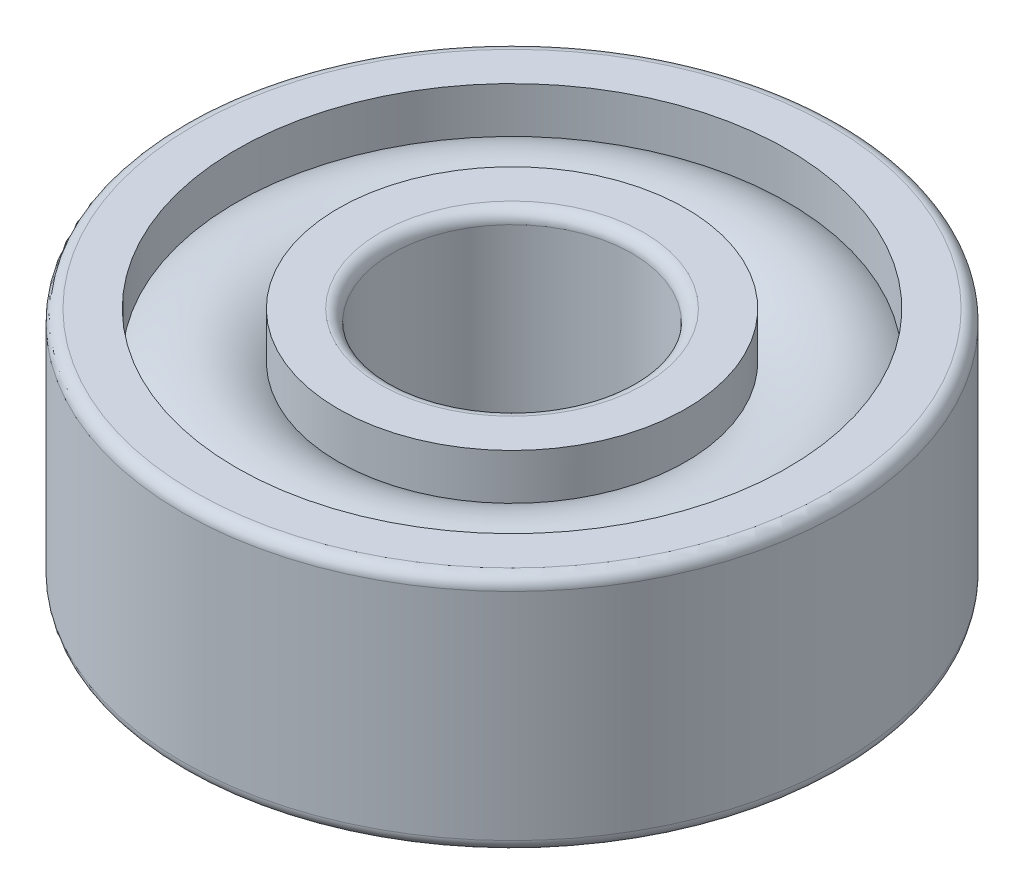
ISO-10303-21;
HEADER;
FILE_DESCRIPTION(('STEP AP214'),'2;1');
FILE_NAME('part.step','',(''),(''),'','','');
FILE_SCHEMA(('AUTOMOTIVE_DESIGN { 1 0 10303 214 1 1 1 1 }'));
ENDSEC;
DATA;
#1=APPLICATION_CONTEXT('core data for automotive mechanical design processes');
#2=APPLICATION_PROTOCOL_DEFINITION('international standard','automotive_design',2000,#1);
#3=PRODUCT_CONTEXT('',#1,'mechanical');
#4=PRODUCT('Part','Part','',(#3));
#5=PRODUCT_RELATED_PRODUCT_CATEGORY('part','',(#4));
#6=PRODUCT_DEFINITION_FORMATION('','',#4);
#7=PRODUCT_DEFINITION_CONTEXT('part definition',#1,'design');
#8=PRODUCT_DEFINITION('design','',#6,#7);
#9=PRODUCT_DEFINITION_SHAPE('','',#8);
#10=(LENGTH_UNIT() NAMED_UNIT(*) SI_UNIT(.MILLI.,.METRE.));
#11=(NAMED_UNIT(*) PLANE_ANGLE_UNIT() SI_UNIT($,.RADIAN.));
#12=(NAMED_UNIT(*) SI_UNIT($,.STERADIAN.) SOLID_ANGLE_UNIT());
#13=UNCERTAINTY_MEASURE_WITH_UNIT(LENGTH_MEASURE(1.E-05),#10,'distance_accuracy_value','');
#14=(GEOMETRIC_REPRESENTATION_CONTEXT(3) GLOBAL_UNCERTAINTY_ASSIGNED_CONTEXT((#13)) GLOBAL_UNIT_ASSIGNED_CONTEXT((#10,
#11,#12)) REPRESENTATION_CONTEXT('',''));
#15=CARTESIAN_POINT('',(0.,0.,0.));
#16=DIRECTION('',(0.,0.,1.));
#17=DIRECTION('',(1.,0.,0.));
#18=AXIS2_PLACEMENT_3D('',#15,#16,#17);
#19=CARTESIAN_POINT('',(0.,-2.2,0.));
#20=DIRECTION('',(0.,1.,0.));
#21=DIRECTION('',(0.,0.,1.));
#22=AXIS2_PLACEMENT_3D('',#19,#20,#21);
#23=CYLINDRICAL_SURFACE('',#22,2.);
#24=CARTESIAN_POINT('',(0.,1.8,0.));
#25=DIRECTION('',(0.,1.,0.));
#26=DIRECTION('',(0.,0.,-1.));
#27=AXIS2_PLACEMENT_3D('',#24,#25,#26);
#28=CIRCLE('',#27,2.);
#29=CARTESIAN_POINT('',(0.,1.8,-2.));
#30=VERTEX_POINT('',#29);
#31=EDGE_CURVE('E65',#30,#30,#28,.F.);
#32=ORIENTED_EDGE('',*,*,#31,.F.);
#33=EDGE_LOOP('',(#32));
#34=FACE_BOUND('',#33,.T.);
#35=CARTESIAN_POINT('',(0.,-1.8,0.));
#36=DIRECTION('',(0.,1.,0.));
#37=DIRECTION('',(0.,0.,-1.));
#38=AXIS2_PLACEMENT_3D('',#35,#36,#37);
#39=CIRCLE('',#38,2.);
#40=CARTESIAN_POINT('',(0.,-1.8,-2.));
#41=VERTEX_POINT('',#40);
#42=EDGE_CURVE('E127',#41,#41,#39,.T.);
#43=ORIENTED_EDGE('',*,*,#42,.F.);
#44=EDGE_LOOP('',(#43));
#45=FACE_BOUND('',#44,.T.);
#46=ADVANCED_FACE('F16',(#34,#45),#23,.F.);
#47=CARTESIAN_POINT('',(0.,-1.8,0.));
#48=DIRECTION('',(0.,1.,0.));
#49=DIRECTION('',(0.,0.,-1.));
#50=AXIS2_PLACEMENT_3D('',#47,#48,#49);
#51=TOROIDAL_SURFACE('',#50,2.2,0.2);
#52=ORIENTED_EDGE('',*,*,#42,.T.);
#53=EDGE_LOOP('',(#52));
#54=FACE_BOUND('',#53,.T.);
#55=CARTESIAN_POINT('',(0.,-2.,0.));
#56=DIRECTION('',(0.,-1.,0.));
#57=DIRECTION('',(0.,0.,1.));
#58=AXIS2_PLACEMENT_3D('',#55,#56,#57);
#59=CIRCLE('',#58,2.2);
#60=CARTESIAN_POINT('',(0.,-2.,2.2));
#61=VERTEX_POINT('',#60);
#62=CARTESIAN_POINT('',(0.,-2.,-2.2));
#63=VERTEX_POINT('',#62);
#64=EDGE_CURVE('E54',#61,#63,#59,.T.);
#65=ORIENTED_EDGE('',*,*,#64,.T.);
#66=CARTESIAN_POINT('',(0.,-2.,0.));
#67=DIRECTION('',(0.,-1.,0.));
#68=DIRECTION('',(0.,0.,-1.));
#69=AXIS2_PLACEMENT_3D('',#66,#67,#68);
#70=CIRCLE('',#69,2.2);
#71=EDGE_CURVE('E52',#63,#61,#70,.T.);
#72=ORIENTED_EDGE('',*,*,#71,.T.);
#73=EDGE_LOOP('',(#65,#72));
#74=FACE_BOUND('',#73,.T.);
#75=ADVANCED_FACE('F56',(#54,#74),#51,.T.);
#76=CARTESIAN_POINT('',(0.,1.8,0.));
#77=DIRECTION('',(0.,1.,0.));
#78=DIRECTION('',(0.,0.,-1.));
#79=AXIS2_PLACEMENT_3D('',#76,#77,#78);
#80=TOROIDAL_SURFACE('',#79,2.2,0.2);
#81=CARTESIAN_POINT('',(0.,2.,0.));
#82=DIRECTION('',(0.,1.,0.));
#83=DIRECTION('',(0.,0.,1.));
#84=AXIS2_PLACEMENT_3D('',#81,#82,#83);
#85=CIRCLE('',#84,2.2);
#86=CARTESIAN_POINT('',(0.,2.,-2.2));
#87=VERTEX_POINT('',#86);
#88=CARTESIAN_POINT('',(0.,2.,2.2));
#89=VERTEX_POINT('',#88);
#90=EDGE_CURVE('E59',#87,#89,#85,.F.);
#91=ORIENTED_EDGE('',*,*,#90,.F.);
#92=CARTESIAN_POINT('',(0.,2.,0.));
#93=DIRECTION('',(0.,1.,0.));
#94=DIRECTION('',(0.,0.,-1.));
#95=AXIS2_PLACEMENT_3D('',#92,#93,#94);
#96=CIRCLE('',#95,2.2);
#97=EDGE_CURVE('E103',#89,#87,#96,.F.);
#98=ORIENTED_EDGE('',*,*,#97,.F.);
#99=EDGE_LOOP('',(#91,#98));
#100=FACE_BOUND('',#99,.T.);
#101=ORIENTED_EDGE('',*,*,#31,.T.);
#102=EDGE_LOOP('',(#101));
#103=FACE_BOUND('',#102,.T.);
#104=ADVANCED_FACE('F85',(#100,#103),#80,.T.);
#105=CARTESIAN_POINT('',(0.,-2.,0.));
#106=DIRECTION('',(0.,1.,0.));
#107=DIRECTION('',(0.,0.,1.));
#108=AXIS2_PLACEMENT_3D('',#105,#106,#107);
#109=PLANE('',#108);
#110=ORIENTED_EDGE('',*,*,#71,.F.);
#111=ORIENTED_EDGE('',*,*,#64,.F.);
#112=EDGE_LOOP('',(#110,#111));
#113=FACE_BOUND('',#112,.T.);
#114=CARTESIAN_POINT('',(0.,-2.,0.));
#115=DIRECTION('',(0.,1.,0.));
#116=DIRECTION('',(0.,0.,1.));
#117=AXIS2_PLACEMENT_3D('',#114,#115,#116);
#118=CIRCLE('',#117,2.9);
#119=CARTESIAN_POINT('',(0.,-2.,2.9));
#120=VERTEX_POINT('',#119);
#121=EDGE_CURVE('E141',#120,#120,#118,.T.);
#122=ORIENTED_EDGE('',*,*,#121,.F.);
#123=EDGE_LOOP('',(#122));
#124=FACE_BOUND('',#123,.T.);
#125=ADVANCED_FACE('F63',(#113,#124),#109,.F.);
#126=CARTESIAN_POINT('',(0.,2.,0.));
#127=DIRECTION('',(0.,1.,0.));
#128=DIRECTION('',(0.,0.,1.));
#129=AXIS2_PLACEMENT_3D('',#126,#127,#128);
#130=PLANE('',#129);
#131=ORIENTED_EDGE('',*,*,#90,.T.);
#132=ORIENTED_EDGE('',*,*,#97,.T.);
#133=EDGE_LOOP('',(#131,#132));
#134=FACE_BOUND('',#133,.T.);
#135=CARTESIAN_POINT('',(0.,2.,0.));
#136=DIRECTION('',(0.,1.,0.));
#137=DIRECTION('',(0.,0.,1.));
#138=AXIS2_PLACEMENT_3D('',#135,#136,#137);
#139=CIRCLE('',#138,2.9);
#140=CARTESIAN_POINT('',(0.,2.,2.9));
#141=VERTEX_POINT('',#140);
#142=EDGE_CURVE('E137',#141,#141,#139,.F.);
#143=ORIENTED_EDGE('',*,*,#142,.F.);
#144=EDGE_LOOP('',(#143));
#145=FACE_BOUND('',#144,.T.);
#146=ADVANCED_FACE('F84',(#134,#145),#130,.T.);
#147=CARTESIAN_POINT('',(0.,-2.2,0.));
#148=DIRECTION('',(0.,1.,0.));
#149=DIRECTION('',(0.,0.,1.));
#150=AXIS2_PLACEMENT_3D('',#147,#148,#149);
#151=CYLINDRICAL_SURFACE('',#150,2.9);
#152=ORIENTED_EDGE('',*,*,#121,.T.);
#153=EDGE_LOOP('',(#152));
#154=FACE_BOUND('',#153,.T.);
#155=CARTESIAN_POINT('',(0.,-1.23592070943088,0.));
#156=DIRECTION('',(0.,1.,0.));
#157=DIRECTION('',(0.,0.,-1.));
#158=AXIS2_PLACEMENT_3D('',#155,#156,#157);
#159=CIRCLE('',#158,2.90000000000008);
#160=CARTESIAN_POINT('',(0.,-1.23592070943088,-2.90000000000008));
#161=VERTEX_POINT('',#160);
#162=EDGE_CURVE('E140',#161,#161,#159,.T.);
#163=ORIENTED_EDGE('',*,*,#162,.F.);
#164=EDGE_LOOP('',(#163));
#165=FACE_BOUND('',#164,.T.);
#166=ADVANCED_FACE('F278',(#154,#165),#151,.T.);
#167=CARTESIAN_POINT('',(0.,-2.2,0.));
#168=DIRECTION('',(0.,1.,0.));
#169=DIRECTION('',(0.,0.,1.));
#170=AXIS2_PLACEMENT_3D('',#167,#168,#169);
#171=CYLINDRICAL_SURFACE('',#170,2.9);
#172=CARTESIAN_POINT('',(0.,1.23592070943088,0.));
#173=DIRECTION('',(0.,1.,0.));
#174=DIRECTION('',(0.,0.,-1.));
#175=AXIS2_PLACEMENT_3D('',#172,#173,#174);
#176=CIRCLE('',#175,2.90000000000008);
#177=CARTESIAN_POINT('',(0.,1.23592070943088,-2.90000000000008));
#178=VERTEX_POINT('',#177);
#179=EDGE_CURVE('E262',#178,#178,#176,.F.);
#180=ORIENTED_EDGE('',*,*,#179,.F.);
#181=EDGE_LOOP('',(#180));
#182=FACE_BOUND('',#181,.T.);
#183=ORIENTED_EDGE('',*,*,#142,.T.);
#184=EDGE_LOOP('',(#183));
#185=FACE_BOUND('',#184,.T.);
#186=ADVANCED_FACE('F257',(#182,#185),#171,.T.);
#187=CARTESIAN_POINT('',(0.,0.,0.));
#188=DIRECTION('',(0.,1.,0.));
#189=DIRECTION('',(0.,0.,-1.));
#190=AXIS2_PLACEMENT_3D('',#187,#188,#189);
#191=TOROIDAL_SURFACE('',#190,3.75,1.5);
#192=ORIENTED_EDGE('',*,*,#162,.T.);
#193=EDGE_LOOP('',(#192));
#194=FACE_BOUND('',#193,.T.);
#195=CARTESIAN_POINT('',(0.,-1.235920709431,0.));
#196=DIRECTION('',(0.,1.,0.));
#197=DIRECTION('',(0.,0.,1.));
#198=AXIS2_PLACEMENT_3D('',#195,#196,#197);
#199=CIRCLE('',#198,4.6);
#200=CARTESIAN_POINT('',(0.,-1.235920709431,4.6));
#201=VERTEX_POINT('',#200);
#202=EDGE_CURVE('E261',#201,#201,#199,.F.);
#203=ORIENTED_EDGE('',*,*,#202,.T.);
#204=EDGE_LOOP('',(#203));
#205=FACE_BOUND('',#204,.T.);
#206=ADVANCED_FACE('F252',(#194,#205),#191,.T.);
#207=CARTESIAN_POINT('',(0.,0.,0.));
#208=DIRECTION('',(0.,1.,0.));
#209=DIRECTION('',(0.,0.,-1.));
#210=AXIS2_PLACEMENT_3D('',#207,#208,#209);
#211=TOROIDAL_SURFACE('',#210,3.75,1.5);
#212=CARTESIAN_POINT('',(0.,1.235920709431,0.));
#213=DIRECTION('',(0.,1.,0.));
#214=DIRECTION('',(0.,0.,1.));
#215=AXIS2_PLACEMENT_3D('',#212,#213,#214);
#216=CIRCLE('',#215,4.6);
#217=CARTESIAN_POINT('',(0.,1.235920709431,4.6));
#218=VERTEX_POINT('',#217);
#219=EDGE_CURVE('E136',#218,#218,#216,.T.);
#220=ORIENTED_EDGE('',*,*,#219,.T.);
#221=EDGE_LOOP('',(#220));
#222=FACE_BOUND('',#221,.T.);
#223=ORIENTED_EDGE('',*,*,#179,.T.);
#224=EDGE_LOOP('',(#223));
#225=FACE_BOUND('',#224,.T.);
#226=ADVANCED_FACE('F247',(#222,#225),#211,.T.);
#227=CARTESIAN_POINT('',(0.,-2.2,0.));
#228=DIRECTION('',(0.,1.,0.));
#229=DIRECTION('',(0.,0.,1.));
#230=AXIS2_PLACEMENT_3D('',#227,#228,#229);
#231=CYLINDRICAL_SURFACE('',#230,4.6);
#232=ORIENTED_EDGE('',*,*,#202,.F.);
#233=EDGE_LOOP('',(#232));
#234=FACE_BOUND('',#233,.T.);
#235=CARTESIAN_POINT('',(0.,-2.,0.));
#236=DIRECTION('',(0.,1.,0.));
#237=DIRECTION('',(0.,0.,1.));
#238=AXIS2_PLACEMENT_3D('',#235,#236,#237);
#239=CIRCLE('',#238,4.6);
#240=CARTESIAN_POINT('',(0.,-2.,4.6));
#241=VERTEX_POINT('',#240);
#242=EDGE_CURVE('E133',#241,#241,#239,.F.);
#243=ORIENTED_EDGE('',*,*,#242,.T.);
#244=EDGE_LOOP('',(#243));
#245=FACE_BOUND('',#244,.T.);
#246=ADVANCED_FACE('F251',(#234,#245),#231,.F.);
#247=CARTESIAN_POINT('',(0.,-2.2,0.));
#248=DIRECTION('',(0.,1.,0.));
#249=DIRECTION('',(0.,0.,1.));
#250=AXIS2_PLACEMENT_3D('',#247,#248,#249);
#251=CYLINDRICAL_SURFACE('',#250,4.6);
#252=CARTESIAN_POINT('',(0.,2.,0.));
#253=DIRECTION('',(0.,1.,0.));
#254=DIRECTION('',(0.,0.,1.));
#255=AXIS2_PLACEMENT_3D('',#252,#253,#254);
#256=CIRCLE('',#255,4.6);
#257=CARTESIAN_POINT('',(0.,2.,4.6));
#258=VERTEX_POINT('',#257);
#259=EDGE_CURVE('E130',#258,#258,#256,.F.);
#260=ORIENTED_EDGE('',*,*,#259,.F.);
#261=EDGE_LOOP('',(#260));
#262=FACE_BOUND('',#261,.T.);
#263=ORIENTED_EDGE('',*,*,#219,.F.);
#264=EDGE_LOOP('',(#263));
#265=FACE_BOUND('',#264,.T.);
#266=ADVANCED_FACE('F335',(#262,#265),#251,.F.);
#267=CARTESIAN_POINT('',(0.,-2.,0.));
#268=DIRECTION('',(0.,1.,0.));
#269=DIRECTION('',(0.,0.,1.));
#270=AXIS2_PLACEMENT_3D('',#267,#268,#269);
#271=PLANE('',#270);
#272=ORIENTED_EDGE('',*,*,#242,.F.);
#273=EDGE_LOOP('',(#272));
#274=FACE_BOUND('',#273,.T.);
#275=CARTESIAN_POINT('',(0.,-2.,0.));
#276=DIRECTION('',(0.,1.,0.));
#277=DIRECTION('',(0.,0.,-1.));
#278=AXIS2_PLACEMENT_3D('',#275,#276,#277);
#279=CIRCLE('',#278,5.3);
#280=CARTESIAN_POINT('',(0.,-2.,-5.3));
#281=VERTEX_POINT('',#280);
#282=CARTESIAN_POINT('',(0.,-2.,5.3));
#283=VERTEX_POINT('',#282);
#284=EDGE_CURVE('E213',#281,#283,#279,.T.);
#285=ORIENTED_EDGE('',*,*,#284,.F.);
#286=CARTESIAN_POINT('',(0.,-2.,0.));
#287=DIRECTION('',(0.,1.,0.));
#288=DIRECTION('',(0.,0.,1.));
#289=AXIS2_PLACEMENT_3D('',#286,#287,#288);
#290=CIRCLE('',#289,5.3);
#291=EDGE_CURVE('E224',#283,#281,#290,.T.);
#292=ORIENTED_EDGE('',*,*,#291,.F.);
#293=EDGE_LOOP('',(#285,#292));
#294=FACE_BOUND('',#293,.T.);
#295=ADVANCED_FACE('F187',(#274,#294),#271,.F.);
#296=CARTESIAN_POINT('',(0.,2.,0.));
#297=DIRECTION('',(0.,1.,0.));
#298=DIRECTION('',(0.,0.,1.));
#299=AXIS2_PLACEMENT_3D('',#296,#297,#298);
#300=PLANE('',#299);
#301=ORIENTED_EDGE('',*,*,#259,.T.);
#302=EDGE_LOOP('',(#301));
#303=FACE_BOUND('',#302,.T.);
#304=CARTESIAN_POINT('',(0.,2.,0.));
#305=DIRECTION('',(0.,-1.,0.));
#306=DIRECTION('',(0.,0.,1.));
#307=AXIS2_PLACEMENT_3D('',#304,#305,#306);
#308=CIRCLE('',#307,5.3);
#309=CARTESIAN_POINT('',(0.,2.,5.3));
#310=VERTEX_POINT('',#309);
#311=CARTESIAN_POINT('',(0.,2.,-5.3));
#312=VERTEX_POINT('',#311);
#313=EDGE_CURVE('E34',#310,#312,#308,.T.);
#314=ORIENTED_EDGE('',*,*,#313,.F.);
#315=CARTESIAN_POINT('',(0.,2.,0.));
#316=DIRECTION('',(0.,-1.,0.));
#317=DIRECTION('',(0.,0.,-1.));
#318=AXIS2_PLACEMENT_3D('',#315,#316,#317);
#319=CIRCLE('',#318,5.3);
#320=EDGE_CURVE('E200',#312,#310,#319,.T.);
#321=ORIENTED_EDGE('',*,*,#320,.F.);
#322=EDGE_LOOP('',(#314,#321));
#323=FACE_BOUND('',#322,.T.);
#324=ADVANCED_FACE('F178',(#303,#323),#300,.T.);
#325=CARTESIAN_POINT('',(0.,-1.8,0.));
#326=DIRECTION('',(0.,1.,0.));
#327=DIRECTION('',(0.,0.,-1.));
#328=AXIS2_PLACEMENT_3D('',#325,#326,#327);
#329=TOROIDAL_SURFACE('',#328,5.3,0.2);
#330=CARTESIAN_POINT('',(0.,-1.8,0.));
#331=DIRECTION('',(0.,1.,0.));
#332=DIRECTION('',(0.,0.,1.));
#333=AXIS2_PLACEMENT_3D('',#330,#331,#332);
#334=CIRCLE('',#333,5.5);
#335=CARTESIAN_POINT('',(0.,-1.8,5.5));
#336=VERTEX_POINT('',#335);
#337=EDGE_CURVE('E26',#336,#336,#334,.T.);
#338=ORIENTED_EDGE('',*,*,#337,.F.);
#339=EDGE_LOOP('',(#338));
#340=FACE_BOUND('',#339,.T.);
#341=ORIENTED_EDGE('',*,*,#291,.T.);
#342=ORIENTED_EDGE('',*,*,#284,.T.);
#343=EDGE_LOOP('',(#341,#342));
#344=FACE_BOUND('',#343,.T.);
#345=ADVANCED_FACE('F164',(#340,#344),#329,.T.);
#346=CARTESIAN_POINT('',(0.,1.8,0.));
#347=DIRECTION('',(0.,1.,0.));
#348=DIRECTION('',(0.,0.,-1.));
#349=AXIS2_PLACEMENT_3D('',#346,#347,#348);
#350=TOROIDAL_SURFACE('',#349,5.3,0.2);
#351=ORIENTED_EDGE('',*,*,#313,.T.);
#352=ORIENTED_EDGE('',*,*,#320,.T.);
#353=EDGE_LOOP('',(#351,#352));
#354=FACE_BOUND('',#353,.T.);
#355=CARTESIAN_POINT('',(0.,1.8,0.));
#356=DIRECTION('',(0.,1.,0.));
#357=DIRECTION('',(0.,0.,1.));
#358=AXIS2_PLACEMENT_3D('',#355,#356,#357);
#359=CIRCLE('',#358,5.5);
#360=CARTESIAN_POINT('',(0.,1.8,5.5));
#361=VERTEX_POINT('',#360);
#362=EDGE_CURVE('E11',#361,#361,#359,.F.);
#363=ORIENTED_EDGE('',*,*,#362,.F.);
#364=EDGE_LOOP('',(#363));
#365=FACE_BOUND('',#364,.T.);
#366=ADVANCED_FACE('F152',(#354,#365),#350,.T.);
#367=CARTESIAN_POINT('',(0.,-2.2,0.));
#368=DIRECTION('',(0.,1.,0.));
#369=DIRECTION('',(0.,0.,1.));
#370=AXIS2_PLACEMENT_3D('',#367,#368,#369);
#371=CYLINDRICAL_SURFACE('',#370,5.5);
#372=ORIENTED_EDGE('',*,*,#362,.T.);
#373=EDGE_LOOP('',(#372));
#374=FACE_BOUND('',#373,.T.);
#375=ORIENTED_EDGE('',*,*,#337,.T.);
#376=EDGE_LOOP('',(#375));
#377=FACE_BOUND('',#376,.T.);
#378=ADVANCED_FACE('F163',(#374,#377),#371,.T.);
#379=CLOSED_SHELL('',(#46,#75,#104,#125,#146,#166,#186,#206,#226,#246,#266,#295,#324,#345,#366,#378));
#380=MANIFOLD_SOLID_BREP('B1',#379);
#381=ADVANCED_BREP_SHAPE_REPRESENTATION('',(#18,#380),#14);
#382=SHAPE_DEFINITION_REPRESENTATION(#9,#381);
ENDSEC;
END-ISO-10303-21;
